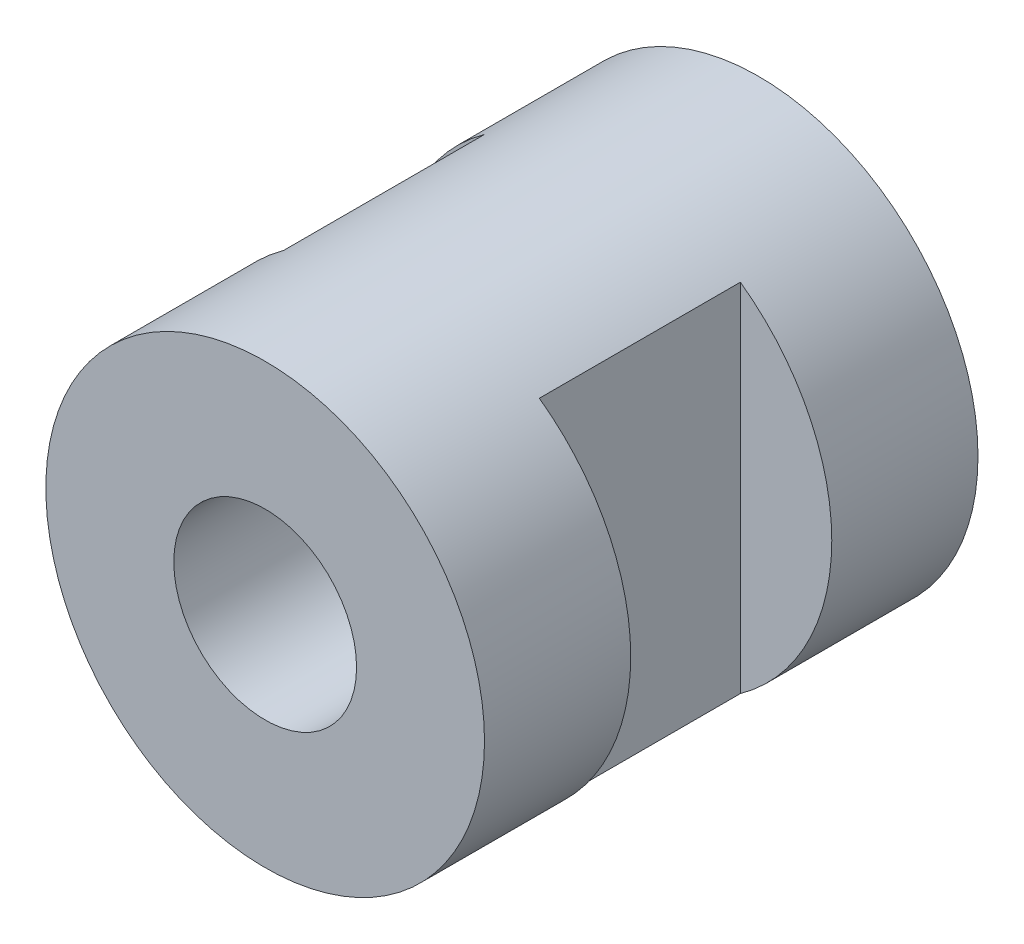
from build123d import *

# Parameters (mm, degrees)
SKETCH_1_R          = 6
EXTRUDE_1_DEPTH     = 13.5
SKETCH_2_W          = 4.286413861
SKETCH_2_H          = 5.5
CUT_EXTRUDE_1_DEPTH = 22.77728174
SKETCH_3_R          = 2.5
CUT_EXTRUDE_2_DEPTH = 13.5


with BuildPart() as part:
    # Sketch 1 → Extrude 1 (new body)
    with BuildSketch(Plane.XY):
        Circle(SKETCH_1_R)
    extrude(amount=EXTRUDE_1_DEPTH)

    # Sketch 2 → Cut-Extrude 1 (cut, through all)
    with BuildSketch(Plane(origin=(0, 10, 0), x_dir=(-1, 0, 0), z_dir=(0, 1, 0))):
        with Locations((-5.64320693, 6.75)):
            Rectangle(SKETCH_2_W, SKETCH_2_H)
        with Locations((5.64320693, 6.75)):
            Rectangle(SKETCH_2_W, SKETCH_2_H)
    extrude(amount=-CUT_EXTRUDE_1_DEPTH, mode=Mode.SUBTRACT)

    # Sketch 3 → Cut-Extrude 2 (cut)
    with BuildSketch(Plane(origin=(0, 0, 0), x_dir=(-1, 0, 0), z_dir=(0, 0, -1))):
        Circle(SKETCH_3_R)
    extrude(amount=-CUT_EXTRUDE_2_DEPTH, mode=Mode.SUBTRACT)


solid = part.part
